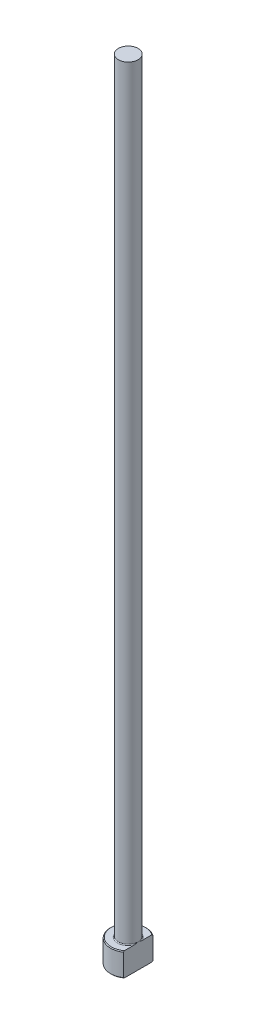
ISO-10303-21;
HEADER;
FILE_DESCRIPTION(('STEP AP214'),'2;1');
FILE_NAME('part.step','',(''),(''),'','','');
FILE_SCHEMA(('AUTOMOTIVE_DESIGN { 1 0 10303 214 1 1 1 1 }'));
ENDSEC;
DATA;
#1=APPLICATION_CONTEXT('core data for automotive mechanical design processes');
#2=APPLICATION_PROTOCOL_DEFINITION('international standard','automotive_design',2000,#1);
#3=PRODUCT_CONTEXT('',#1,'mechanical');
#4=PRODUCT('Part','Part','',(#3));
#5=PRODUCT_RELATED_PRODUCT_CATEGORY('part','',(#4));
#6=PRODUCT_DEFINITION_FORMATION('','',#4);
#7=PRODUCT_DEFINITION_CONTEXT('part definition',#1,'design');
#8=PRODUCT_DEFINITION('design','',#6,#7);
#9=PRODUCT_DEFINITION_SHAPE('','',#8);
#10=(LENGTH_UNIT() NAMED_UNIT(*) SI_UNIT(.MILLI.,.METRE.));
#11=(NAMED_UNIT(*) PLANE_ANGLE_UNIT() SI_UNIT($,.RADIAN.));
#12=(NAMED_UNIT(*) SI_UNIT($,.STERADIAN.) SOLID_ANGLE_UNIT());
#13=UNCERTAINTY_MEASURE_WITH_UNIT(LENGTH_MEASURE(1.E-05),#10,'distance_accuracy_value','');
#14=(GEOMETRIC_REPRESENTATION_CONTEXT(3) GLOBAL_UNCERTAINTY_ASSIGNED_CONTEXT((#13)) GLOBAL_UNIT_ASSIGNED_CONTEXT((#10,
#11,#12)) REPRESENTATION_CONTEXT('',''));
#15=CARTESIAN_POINT('',(0.,0.,0.));
#16=DIRECTION('',(0.,0.,1.));
#17=DIRECTION('',(1.,0.,0.));
#18=AXIS2_PLACEMENT_3D('',#15,#16,#17);
#19=CARTESIAN_POINT('',(0.,0.,0.));
#20=DIRECTION('',(0.,-1.,0.));
#21=DIRECTION('',(0.,0.,-1.));
#22=AXIS2_PLACEMENT_3D('',#19,#20,#21);
#23=PLANE('',#22);
#24=CARTESIAN_POINT('',(0.,0.,0.));
#25=DIRECTION('',(0.,-1.,0.));
#26=DIRECTION('',(0.,0.,-1.));
#27=AXIS2_PLACEMENT_3D('',#24,#25,#26);
#28=CIRCLE('',#27,4.29999999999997);
#29=CARTESIAN_POINT('',(2.49999999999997,0.,3.49857113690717));
#30=VERTEX_POINT('',#29);
#31=CARTESIAN_POINT('',(2.49999999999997,0.,-3.49857113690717));
#32=VERTEX_POINT('',#31);
#33=EDGE_CURVE('E98',#30,#32,#28,.T.);
#34=ORIENTED_EDGE('',*,*,#33,.T.);
#35=DIRECTION('',(0.,0.,1.));
#36=VECTOR('',#35,1.);
#37=CARTESIAN_POINT('',(2.49999999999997,0.,3.74165738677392));
#38=LINE('',#37,#36);
#39=EDGE_CURVE('E83',#32,#30,#38,.T.);
#40=ORIENTED_EDGE('',*,*,#39,.T.);
#41=EDGE_LOOP('',(#34,#40));
#42=FACE_BOUND('',#41,.T.);
#43=ADVANCED_FACE('F32',(#42),#23,.T.);
#44=CARTESIAN_POINT('',(0.,259.958771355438,0.));
#45=DIRECTION('',(0.,1.,0.));
#46=DIRECTION('',(0.,0.,1.));
#47=AXIS2_PLACEMENT_3D('',#44,#45,#46);
#48=CYLINDRICAL_SURFACE('',#47,4.49999999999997);
#49=CARTESIAN_POINT('',(0.,5.80000000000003,0.));
#50=DIRECTION('',(0.,1.,0.));
#51=DIRECTION('',(0.,0.,1.));
#52=AXIS2_PLACEMENT_3D('',#49,#50,#51);
#53=CIRCLE('',#52,4.49999999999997);
#54=CARTESIAN_POINT('',(2.49999999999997,5.80000000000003,3.74165738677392));
#55=VERTEX_POINT('',#54);
#56=CARTESIAN_POINT('',(2.49999999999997,5.80000000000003,-3.74165738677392));
#57=VERTEX_POINT('',#56);
#58=EDGE_CURVE('E104',#55,#57,#53,.F.);
#59=ORIENTED_EDGE('',*,*,#58,.T.);
#60=DIRECTION('',(0.,-1.,0.));
#61=VECTOR('',#60,1.);
#62=CARTESIAN_POINT('',(2.49999999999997,200.,-3.74165738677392));
#63=LINE('',#62,#61);
#64=CARTESIAN_POINT('',(2.49999999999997,0.200000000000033,-3.74165738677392));
#65=VERTEX_POINT('',#64);
#66=EDGE_CURVE('E183',#57,#65,#63,.T.);
#67=ORIENTED_EDGE('',*,*,#66,.T.);
#68=CARTESIAN_POINT('',(0.,0.200000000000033,0.));
#69=DIRECTION('',(0.,-1.,0.));
#70=DIRECTION('',(0.,0.,-1.));
#71=AXIS2_PLACEMENT_3D('',#68,#69,#70);
#72=CIRCLE('',#71,4.49999999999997);
#73=CARTESIAN_POINT('',(2.49999999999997,0.200000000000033,3.74165738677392));
#74=VERTEX_POINT('',#73);
#75=EDGE_CURVE('E100',#65,#74,#72,.F.);
#76=ORIENTED_EDGE('',*,*,#75,.T.);
#77=DIRECTION('',(0.,-1.,0.));
#78=VECTOR('',#77,1.);
#79=CARTESIAN_POINT('',(2.49999999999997,200.,3.74165738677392));
#80=LINE('',#79,#78);
#81=EDGE_CURVE('E93',#55,#74,#80,.T.);
#82=ORIENTED_EDGE('',*,*,#81,.F.);
#83=EDGE_LOOP('',(#59,#67,#76,#82));
#84=FACE_BOUND('',#83,.T.);
#85=ADVANCED_FACE('F158',(#84),#48,.T.);
#86=CARTESIAN_POINT('',(-4.49999999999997,6.,0.));
#87=DIRECTION('',(0.,1.,0.));
#88=DIRECTION('',(0.,0.,1.));
#89=AXIS2_PLACEMENT_3D('',#86,#87,#88);
#90=PLANE('',#89);
#91=CARTESIAN_POINT('',(0.,6.,0.));
#92=DIRECTION('',(0.,1.,0.));
#93=DIRECTION('',(0.,0.,1.));
#94=AXIS2_PLACEMENT_3D('',#91,#92,#93);
#95=CIRCLE('',#94,4.3);
#96=CARTESIAN_POINT('',(2.49999999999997,6.,-3.49857113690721));
#97=VERTEX_POINT('',#96);
#98=CARTESIAN_POINT('',(2.49999999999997,6.,3.49857113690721));
#99=VERTEX_POINT('',#98);
#100=EDGE_CURVE('E178',#97,#99,#95,.T.);
#101=ORIENTED_EDGE('',*,*,#100,.T.);
#102=DIRECTION('',(0.,0.,-1.));
#103=VECTOR('',#102,1.);
#104=CARTESIAN_POINT('',(2.49999999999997,6.,0.));
#105=LINE('',#104,#103);
#106=CARTESIAN_POINT('',(2.49999999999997,5.99999999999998,1.01980390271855));
#107=VERTEX_POINT('',#106);
#108=EDGE_CURVE('E57',#99,#107,#105,.T.);
#109=ORIENTED_EDGE('',*,*,#108,.T.);
#110=CARTESIAN_POINT('',(0.,6.,0.));
#111=DIRECTION('',(0.,1.,0.));
#112=DIRECTION('',(0.,0.,1.));
#113=AXIS2_PLACEMENT_3D('',#110,#111,#112);
#114=CIRCLE('',#113,2.69999999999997);
#115=CARTESIAN_POINT('',(2.49999999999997,5.99999999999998,-1.01980390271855));
#116=VERTEX_POINT('',#115);
#117=EDGE_CURVE('E107',#107,#116,#114,.F.);
#118=ORIENTED_EDGE('',*,*,#117,.T.);
#119=EDGE_CURVE('E136',#116,#97,#105,.T.);
#120=ORIENTED_EDGE('',*,*,#119,.T.);
#121=EDGE_LOOP('',(#101,#109,#118,#120));
#122=FACE_BOUND('',#121,.T.);
#123=ADVANCED_FACE('F147',(#122),#90,.T.);
#124=CARTESIAN_POINT('',(0.,6.00000000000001,0.));
#125=DIRECTION('',(0.,-1.,0.));
#126=DIRECTION('',(0.,0.,-1.));
#127=AXIS2_PLACEMENT_3D('',#124,#125,#126);
#128=CONICAL_SURFACE('',#127,4.3,0.785398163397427);
#129=ORIENTED_EDGE('',*,*,#58,.F.);
#130=CARTESIAN_POINT('',(2.49999999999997,1.69536803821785,8.233449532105));
#131=CARTESIAN_POINT('',(2.49999999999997,1.8415955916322,8.08062583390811));
#132=CARTESIAN_POINT('',(2.49999999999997,1.9876479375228,7.92763429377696));
#133=CARTESIAN_POINT('',(2.49999999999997,2.27932845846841,7.6212454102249));
#134=CARTESIAN_POINT('',(2.49999999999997,2.42495663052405,7.46784806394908));
#135=CARTESIAN_POINT('',(2.49999999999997,2.86116481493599,7.00686753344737));
#136=CARTESIAN_POINT('',(2.49999999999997,3.15099433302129,6.69857321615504));
#137=CARTESIAN_POINT('',(2.49999999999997,3.72884985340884,6.07807253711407));
#138=CARTESIAN_POINT('',(2.49999999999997,4.01686464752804,5.76585569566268));
#139=CARTESIAN_POINT('',(2.49999999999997,4.44539957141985,5.29439081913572));
#140=CARTESIAN_POINT('',(2.49999999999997,4.58765535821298,5.13672163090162));
#141=CARTESIAN_POINT('',(2.49999999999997,4.87066186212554,4.82003964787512));
#142=CARTESIAN_POINT('',(2.49999999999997,5.01141259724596,4.66102686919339));
#143=CARTESIAN_POINT('',(2.49999999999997,5.2957078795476,4.33582683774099));
#144=CARTESIAN_POINT('',(2.49999999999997,5.43918418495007,4.16957975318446));
#145=CARTESIAN_POINT('',(2.49999999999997,5.72327592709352,3.83461659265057));
#146=CARTESIAN_POINT('',(2.49999999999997,5.86389099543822,3.66590020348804));
#147=CARTESIAN_POINT('',(2.49999999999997,6.14107420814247,3.32513857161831));
#148=CARTESIAN_POINT('',(2.49999999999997,6.27764223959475,3.15309323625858));
#149=CARTESIAN_POINT('',(2.49999999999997,6.47795110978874,2.89156777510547));
#150=CARTESIAN_POINT('',(2.49999999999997,6.5439576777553,2.80382460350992));
#151=CARTESIAN_POINT('',(2.49999999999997,6.67408242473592,2.62695176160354));
#152=CARTESIAN_POINT('',(2.49999999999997,6.73820069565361,2.53782215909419));
#153=CARTESIAN_POINT('',(2.49999999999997,6.87152528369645,2.34725612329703));
#154=CARTESIAN_POINT('',(2.49999999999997,6.94043579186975,2.24561149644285));
#155=CARTESIAN_POINT('',(2.49999999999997,7.07436956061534,2.03980429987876));
#156=CARTESIAN_POINT('',(2.49999999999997,7.13939350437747,1.93564217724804));
#157=CARTESIAN_POINT('',(2.49999999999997,7.26425850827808,1.72423874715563));
#158=CARTESIAN_POINT('',(2.49999999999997,7.32410048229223,1.61699798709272));
#159=CARTESIAN_POINT('',(2.49999999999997,7.43673687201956,1.39892979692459));
#160=CARTESIAN_POINT('',(2.49999999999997,7.48953435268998,1.28810395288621));
#161=CARTESIAN_POINT('',(2.49999999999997,7.60157711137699,1.02468144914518));
#162=CARTESIAN_POINT('',(2.49999999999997,7.65714985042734,0.870425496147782));
#163=CARTESIAN_POINT('',(2.49999999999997,7.72191807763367,0.63420526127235));
#164=CARTESIAN_POINT('',(2.49999999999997,7.74039604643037,0.554773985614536));
#165=CARTESIAN_POINT('',(2.49999999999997,7.77027635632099,0.394570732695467));
#166=CARTESIAN_POINT('',(2.49999999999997,7.78167951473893,0.313798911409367));
#167=CARTESIAN_POINT('',(2.49999999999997,7.79679993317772,0.150603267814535));
#168=CARTESIAN_POINT('',(2.49999999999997,7.8004286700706,0.0681710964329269));
#169=CARTESIAN_POINT('',(2.49999999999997,7.7994902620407,-0.0966436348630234));
#170=CARTESIAN_POINT('',(2.49999999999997,7.79492331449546,-0.179026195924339));
#171=CARTESIAN_POINT('',(2.49999999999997,7.77788997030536,-0.343090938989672));
#172=CARTESIAN_POINT('',(2.49999999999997,7.76541077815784,-0.424771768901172));
#173=CARTESIAN_POINT('',(2.49999999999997,7.73330588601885,-0.586708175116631));
#174=CARTESIAN_POINT('',(2.49999999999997,7.71367845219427,-0.666963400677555));
#175=CARTESIAN_POINT('',(2.49999999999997,7.65833470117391,-0.860438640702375));
#176=CARTESIAN_POINT('',(2.49999999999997,7.61933642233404,-0.972715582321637));
#177=CARTESIAN_POINT('',(2.49999999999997,7.53162689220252,-1.19338710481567));
#178=CARTESIAN_POINT('',(2.49999999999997,7.4829089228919,-1.30177893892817));
#179=CARTESIAN_POINT('',(2.49999999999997,7.37798916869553,-1.51554087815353));
#180=CARTESIAN_POINT('',(2.49999999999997,7.3217495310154,-1.62089218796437));
#181=CARTESIAN_POINT('',(2.49999999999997,7.23334776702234,-1.77656150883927));
#182=CARTESIAN_POINT('',(2.49999999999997,7.20321149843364,-1.82805098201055));
#183=CARTESIAN_POINT('',(2.49999999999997,7.14176188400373,-1.93032073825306));
#184=CARTESIAN_POINT('',(2.49999999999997,7.11044858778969,-1.98110105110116));
#185=CARTESIAN_POINT('',(2.49999999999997,7.00428706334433,-2.14944611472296));
#186=CARTESIAN_POINT('',(2.49999999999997,6.9271747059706,-2.26558431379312));
#187=CARTESIAN_POINT('',(2.49999999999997,6.76891329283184,-2.49508800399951));
#188=CARTESIAN_POINT('',(2.49999999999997,6.68776326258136,-2.60845281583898));
#189=CARTESIAN_POINT('',(2.49999999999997,6.5223882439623,-2.83304153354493));
#190=CARTESIAN_POINT('',(2.49999999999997,6.43816097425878,-2.94426375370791));
#191=CARTESIAN_POINT('',(2.49999999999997,6.26739791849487,-3.16492607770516));
#192=CARTESIAN_POINT('',(2.49999999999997,6.18086198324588,-3.27436606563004));
#193=CARTESIAN_POINT('',(2.49999999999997,6.00577178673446,-3.49207549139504));
#194=CARTESIAN_POINT('',(2.49999999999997,5.91721294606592,-3.60034123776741));
#195=CARTESIAN_POINT('',(2.49999999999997,5.7386592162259,-3.81568349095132));
#196=CARTESIAN_POINT('',(2.49999999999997,5.64866429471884,-3.92275997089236));
#197=CARTESIAN_POINT('',(2.49999999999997,5.37704561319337,-4.24242567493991));
#198=CARTESIAN_POINT('',(2.49999999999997,5.19370393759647,-4.45355444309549));
#199=CARTESIAN_POINT('',(2.49999999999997,4.82367634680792,-4.87338717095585));
#200=CARTESIAN_POINT('',(2.49999999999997,4.63698598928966,-5.08208719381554));
#201=CARTESIAN_POINT('',(2.49999999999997,4.26138721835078,-5.49751911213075));
#202=CARTESIAN_POINT('',(2.49999999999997,4.0724785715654,-5.70425079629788));
#203=CARTESIAN_POINT('',(2.49999999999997,3.6932962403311,-6.11595801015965));
#204=CARTESIAN_POINT('',(2.49999999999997,3.50302465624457,-6.32093547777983));
#205=CARTESIAN_POINT('',(2.49999999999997,3.12126439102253,-6.72975403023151));
#206=CARTESIAN_POINT('',(2.49999999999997,2.92977570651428,-6.93359511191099));
#207=CARTESIAN_POINT('',(2.49999999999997,2.65119470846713,-7.22877144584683));
#208=CARTESIAN_POINT('',(2.49999999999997,2.5644779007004,-7.32046158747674));
#209=CARTESIAN_POINT('',(2.49999999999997,2.39085496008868,-7.50369470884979));
#210=CARTESIAN_POINT('',(2.49999999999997,2.30394879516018,-7.59523765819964));
#211=CARTESIAN_POINT('',(2.49999999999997,2.13016920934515,-7.77797738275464));
#212=CARTESIAN_POINT('',(2.49999999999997,2.04329612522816,-7.8691744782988));
#213=CARTESIAN_POINT('',(2.49999999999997,1.86942568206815,-8.05141764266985));
#214=CARTESIAN_POINT('',(2.49999999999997,1.78242834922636,-8.14246373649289));
#215=CARTESIAN_POINT('',(2.49999999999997,1.69536803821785,-8.233449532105));
#216=B_SPLINE_CURVE_WITH_KNOTS('',3,(#130,#131,#132,#133,#134,#135,#136,#137,#138,#139,#140,
#141,#142,#143,#144,#145,#146,#147,#148,#149,#150,#151,#152,#153,#154,#155,#156,#157,#158,#159,
#160,#161,#162,#163,#164,#165,#166,#167,#168,#169,#170,#171,#172,#173,#174,#175,#176,#177,#178,
#179,#180,#181,#182,#183,#184,#185,#186,#187,#188,#189,#190,#191,#192,#193,#194,#195,#196,#197,
#198,#199,#200,#201,#202,#203,#204,#205,#206,#207,#208,#209,#210,#211,#212,#213,#214,#215),
.UNSPECIFIED.,.F.,.F.,(4,2,2,2,2,2,2,2,2,2,2,2,2,2,2,2,2,2,2,2,2,2,2,2,2,2,2,2,2,2,2,2,2,2,2,2,
2,2,2,2,2,2,4),(0.,0.634537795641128,1.26908006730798,2.53848610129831,3.81276948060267,
4.44983884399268,5.08690057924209,5.74567154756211,6.40452680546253,7.06340042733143,
7.3927766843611,7.7221368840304,8.09047335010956,8.45874487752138,8.82695132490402,
9.19499704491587,9.6851523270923,9.92954493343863,10.1739093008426,10.421041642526,
10.6681680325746,10.915695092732,11.1632822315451,11.5192140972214,11.8753928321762,
12.2334366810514,12.4124062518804,12.5913682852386,13.0094573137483,13.4276477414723,
13.8461547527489,14.2646888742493,14.6842890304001,15.1038986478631,15.942718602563,
16.7827484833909,17.6228675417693,18.4618914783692,19.3009177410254,19.679522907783,
20.0581981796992,20.4360532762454,20.8138378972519),.UNSPECIFIED.);
#217=EDGE_CURVE('E135',#55,#99,#216,.T.);
#218=ORIENTED_EDGE('',*,*,#217,.T.);
#219=ORIENTED_EDGE('',*,*,#100,.F.);
#220=EDGE_CURVE('E127',#97,#57,#216,.T.);
#221=ORIENTED_EDGE('',*,*,#220,.T.);
#222=EDGE_LOOP('',(#129,#218,#219,#221));
#223=FACE_BOUND('',#222,.T.);
#224=ADVANCED_FACE('F143',(#223),#128,.T.);
#225=CARTESIAN_POINT('',(0.,0.200000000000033,0.));
#226=DIRECTION('',(0.,1.,0.));
#227=DIRECTION('',(0.,0.,1.));
#228=AXIS2_PLACEMENT_3D('',#225,#226,#227);
#229=CONICAL_SURFACE('',#228,4.49999999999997,0.785398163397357);
#230=ORIENTED_EDGE('',*,*,#75,.F.);
#231=CARTESIAN_POINT('',(2.49999999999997,4.30463196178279,-8.233449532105));
#232=CARTESIAN_POINT('',(2.49999999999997,4.1584044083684,-8.08062583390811));
#233=CARTESIAN_POINT('',(2.49999999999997,4.01235206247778,-7.92763429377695));
#234=CARTESIAN_POINT('',(2.49999999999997,3.72067154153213,-7.62124541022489));
#235=CARTESIAN_POINT('',(2.49999999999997,3.57504336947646,-7.46784806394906));
#236=CARTESIAN_POINT('',(2.49999999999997,3.13883518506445,-7.00686753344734));
#237=CARTESIAN_POINT('',(2.49999999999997,2.84900566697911,-6.69857321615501));
#238=CARTESIAN_POINT('',(2.49999999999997,2.27115014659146,-6.07807253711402));
#239=CARTESIAN_POINT('',(2.49999999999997,1.98313535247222,-5.76585569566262));
#240=CARTESIAN_POINT('',(2.49999999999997,1.55460042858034,-5.29439081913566));
#241=CARTESIAN_POINT('',(2.49999999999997,1.41234464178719,-5.13672163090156));
#242=CARTESIAN_POINT('',(2.49999999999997,1.12933813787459,-4.82003964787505));
#243=CARTESIAN_POINT('',(2.49999999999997,0.988587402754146,-4.66102686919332));
#244=CARTESIAN_POINT('',(2.49999999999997,0.704292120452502,-4.33582683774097));
#245=CARTESIAN_POINT('',(2.49999999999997,0.560815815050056,-4.16957975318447));
#246=CARTESIAN_POINT('',(2.49999999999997,0.276724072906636,-3.83461659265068));
#247=CARTESIAN_POINT('',(2.49999999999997,0.13610900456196,-3.66590020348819));
#248=CARTESIAN_POINT('',(2.49999999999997,-0.141074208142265,-3.32513857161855));
#249=CARTESIAN_POINT('',(2.49999999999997,-0.277642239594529,-3.15309323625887));
#250=CARTESIAN_POINT('',(2.49999999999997,-0.477951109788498,-2.89156777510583));
#251=CARTESIAN_POINT('',(2.49999999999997,-0.54395767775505,-2.8038246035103));
#252=CARTESIAN_POINT('',(2.49999999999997,-0.674082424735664,-2.62695176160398));
#253=CARTESIAN_POINT('',(2.49999999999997,-0.738200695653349,-2.53782215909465));
#254=CARTESIAN_POINT('',(2.49999999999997,-0.871525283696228,-2.34725612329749));
#255=CARTESIAN_POINT('',(2.49999999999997,-0.940435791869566,-2.24561149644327));
#256=CARTESIAN_POINT('',(2.49999999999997,-1.07436956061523,-2.03980429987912));
#257=CARTESIAN_POINT('',(2.49999999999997,-1.13939350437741,-1.93564217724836));
#258=CARTESIAN_POINT('',(2.49999999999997,-1.26425850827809,-1.72423874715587));
#259=CARTESIAN_POINT('',(2.49999999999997,-1.32410048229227,-1.61699798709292));
#260=CARTESIAN_POINT('',(2.49999999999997,-1.43673687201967,-1.39892979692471));
#261=CARTESIAN_POINT('',(2.49999999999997,-1.48953435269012,-1.28810395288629));
#262=CARTESIAN_POINT('',(2.49999999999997,-1.60157711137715,-1.02468144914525));
#263=CARTESIAN_POINT('',(2.49999999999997,-1.6571498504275,-0.870425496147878));
#264=CARTESIAN_POINT('',(2.49999999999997,-1.72191807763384,-0.634205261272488));
#265=CARTESIAN_POINT('',(2.49999999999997,-1.74039604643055,-0.554773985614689));
#266=CARTESIAN_POINT('',(2.49999999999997,-1.77027635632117,-0.394570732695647));
#267=CARTESIAN_POINT('',(2.49999999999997,-1.78167951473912,-0.31379891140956));
#268=CARTESIAN_POINT('',(2.49999999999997,-1.79679993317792,-0.150603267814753));
#269=CARTESIAN_POINT('',(2.49999999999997,-1.80042867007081,-0.068171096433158));
#270=CARTESIAN_POINT('',(2.49999999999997,-1.79949026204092,0.0966436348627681));
#271=CARTESIAN_POINT('',(2.49999999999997,-1.79492331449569,0.179026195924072));
#272=CARTESIAN_POINT('',(2.49999999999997,-1.77788997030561,0.343090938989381));
#273=CARTESIAN_POINT('',(2.49999999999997,-1.7654107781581,0.424771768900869));
#274=CARTESIAN_POINT('',(2.49999999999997,-1.73330588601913,0.586708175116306));
#275=CARTESIAN_POINT('',(2.49999999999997,-1.71367845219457,0.66696340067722));
#276=CARTESIAN_POINT('',(2.49999999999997,-1.65833470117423,0.860438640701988));
#277=CARTESIAN_POINT('',(2.49999999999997,-1.61933642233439,0.972715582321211));
#278=CARTESIAN_POINT('',(2.49999999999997,-1.53162689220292,1.19338710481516));
#279=CARTESIAN_POINT('',(2.49999999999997,-1.48290892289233,1.30177893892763));
#280=CARTESIAN_POINT('',(2.49999999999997,-1.377989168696,1.51554087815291));
#281=CARTESIAN_POINT('',(2.49999999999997,-1.32174953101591,1.62089218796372));
#282=CARTESIAN_POINT('',(2.49999999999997,-1.23334776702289,1.77656150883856));
#283=CARTESIAN_POINT('',(2.49999999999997,-1.2032114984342,1.82805098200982));
#284=CARTESIAN_POINT('',(2.49999999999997,-1.14176188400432,1.93032073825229));
#285=CARTESIAN_POINT('',(2.49999999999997,-1.1104485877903,1.98110105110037));
#286=CARTESIAN_POINT('',(2.49999999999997,-1.00428706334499,2.1494461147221));
#287=CARTESIAN_POINT('',(2.49999999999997,-0.927174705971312,2.26558431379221));
#288=CARTESIAN_POINT('',(2.49999999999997,-0.768913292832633,2.49508800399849));
#289=CARTESIAN_POINT('',(2.49999999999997,-0.687763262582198,2.60845281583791));
#290=CARTESIAN_POINT('',(2.49999999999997,-0.522388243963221,2.83304153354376));
#291=CARTESIAN_POINT('',(2.49999999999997,-0.438160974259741,2.94426375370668));
#292=CARTESIAN_POINT('',(2.49999999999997,-0.267397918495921,3.16492607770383));
#293=CARTESIAN_POINT('',(2.49999999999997,-0.180861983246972,3.27436606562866));
#294=CARTESIAN_POINT('',(2.49999999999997,-0.00577178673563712,3.49207549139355));
#295=CARTESIAN_POINT('',(2.49999999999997,0.0827870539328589,3.60034123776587));
#296=CARTESIAN_POINT('',(2.49999999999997,0.261340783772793,3.81568349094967));
#297=CARTESIAN_POINT('',(2.49999999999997,0.351335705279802,3.92275997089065));
#298=CARTESIAN_POINT('',(2.49999999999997,0.622954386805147,4.24242567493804));
#299=CARTESIAN_POINT('',(2.49999999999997,0.806296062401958,4.45355444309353));
#300=CARTESIAN_POINT('',(2.49999999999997,1.17632365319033,4.87338717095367));
#301=CARTESIAN_POINT('',(2.49999999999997,1.36301401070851,5.08208719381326));
#302=CARTESIAN_POINT('',(2.49999999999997,1.73861278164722,5.49751911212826));
#303=CARTESIAN_POINT('',(2.49999999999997,1.92752142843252,5.70425079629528));
#304=CARTESIAN_POINT('',(2.49999999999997,2.30670375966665,6.11595801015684));
#305=CARTESIAN_POINT('',(2.49999999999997,2.4969753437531,6.32093547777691));
#306=CARTESIAN_POINT('',(2.49999999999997,2.87873560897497,6.72975403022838));
#307=CARTESIAN_POINT('',(2.49999999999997,3.07022429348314,6.93359511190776));
#308=CARTESIAN_POINT('',(2.49999999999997,3.34880529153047,7.22877144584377));
#309=CARTESIAN_POINT('',(2.49999999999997,3.43552209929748,7.32046158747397));
#310=CARTESIAN_POINT('',(2.49999999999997,3.60914503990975,7.50369470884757));
#311=CARTESIAN_POINT('',(2.49999999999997,3.69605120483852,7.5952376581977));
#312=CARTESIAN_POINT('',(2.49999999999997,3.8698307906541,7.77797738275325));
#313=CARTESIAN_POINT('',(2.49999999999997,3.95670387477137,7.8691744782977));
#314=CARTESIAN_POINT('',(2.49999999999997,4.13057431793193,8.0514176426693));
#315=CARTESIAN_POINT('',(2.49999999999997,4.21757165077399,8.14246373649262));
#316=CARTESIAN_POINT('',(2.49999999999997,4.30463196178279,8.233449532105));
#317=B_SPLINE_CURVE_WITH_KNOTS('',3,(#231,#232,#233,#234,#235,#236,#237,#238,#239,#240,#241,
#242,#243,#244,#245,#246,#247,#248,#249,#250,#251,#252,#253,#254,#255,#256,#257,#258,#259,#260,
#261,#262,#263,#264,#265,#266,#267,#268,#269,#270,#271,#272,#273,#274,#275,#276,#277,#278,#279,
#280,#281,#282,#283,#284,#285,#286,#287,#288,#289,#290,#291,#292,#293,#294,#295,#296,#297,#298,
#299,#300,#301,#302,#303,#304,#305,#306,#307,#308,#309,#310,#311,#312,#313,#314,#315,#316),
.UNSPECIFIED.,.F.,.F.,(4,2,2,2,2,2,2,2,2,2,2,2,2,2,2,2,2,2,2,2,2,2,2,2,2,2,2,2,2,2,2,2,2,2,2,2,
2,2,2,2,2,2,4),(0.,0.634537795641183,1.26908006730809,2.53848610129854,3.81276948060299,
4.44983884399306,5.08690057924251,5.7456715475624,6.40452680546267,7.06340042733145,
7.39277668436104,7.72213688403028,8.09047335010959,8.45874487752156,8.82695132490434,
9.19499704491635,9.6851523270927,9.929544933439,10.1739093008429,10.4210416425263,
10.6681680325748,10.9156950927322,11.1632822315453,11.5192140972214,11.8753928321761,
12.2334366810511,12.4124062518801,12.5913682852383,13.0094573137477,13.4276477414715,
13.8461547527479,14.2646888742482,14.6842890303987,15.1038986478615,15.942718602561,
16.7827484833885,17.6228675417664,18.461891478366,19.3009177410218,19.6795229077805,
20.0581981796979,20.4360532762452,20.8138378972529),.UNSPECIFIED.);
#318=EDGE_CURVE('E86',#65,#32,#317,.T.);
#319=ORIENTED_EDGE('',*,*,#318,.T.);
#320=ORIENTED_EDGE('',*,*,#33,.F.);
#321=EDGE_CURVE('E89',#30,#74,#317,.T.);
#322=ORIENTED_EDGE('',*,*,#321,.T.);
#323=EDGE_LOOP('',(#230,#319,#320,#322));
#324=FACE_BOUND('',#323,.T.);
#325=ADVANCED_FACE('F97',(#324),#229,.T.);
#326=CARTESIAN_POINT('',(0.,6.19999999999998,0.));
#327=DIRECTION('',(0.,1.,0.));
#328=DIRECTION('',(0.,0.,1.));
#329=AXIS2_PLACEMENT_3D('',#326,#327,#328);
#330=TOROIDAL_SURFACE('',#329,2.69999999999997,0.2);
#331=CARTESIAN_POINT('',(2.49999999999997,6.19999999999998,0.));
#332=CARTESIAN_POINT('',(2.49999999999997,6.20000050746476,5.29062847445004E-11));
#333=CARTESIAN_POINT('',(2.49999999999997,6.20000101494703,-1.70517162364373E-07));
#334=CARTESIAN_POINT('',(2.49999999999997,6.20000196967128,-6.59443816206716E-07));
#335=CARTESIAN_POINT('',(2.49999999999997,6.20000240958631,-9.87883937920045E-07));
#336=CARTESIAN_POINT('',(2.49999999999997,6.20000331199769,-1.77246894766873E-06));
#337=CARTESIAN_POINT('',(2.49999999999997,6.20000376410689,-2.24097231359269E-06));
#338=CARTESIAN_POINT('',(2.49999999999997,6.20000458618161,-3.2218605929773E-06));
#339=CARTESIAN_POINT('',(2.49999999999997,6.20000495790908,-3.73286589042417E-06));
#340=CARTESIAN_POINT('',(2.49999999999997,6.20000630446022,-5.67453785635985E-06));
#341=CARTESIAN_POINT('',(2.49999999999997,6.20000720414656,-7.15943630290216E-06));
#342=CARTESIAN_POINT('',(2.49999999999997,6.20000871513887,-1.01304383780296E-05));
#343=CARTESIAN_POINT('',(2.49999999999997,6.20000934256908,-1.16087238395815E-05));
#344=CARTESIAN_POINT('',(2.49999999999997,6.20001191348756,-1.77555556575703E-05));
#345=CARTESIAN_POINT('',(2.49999999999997,6.20001378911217,-2.24564507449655E-05));
#346=CARTESIAN_POINT('',(2.49999999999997,6.20001661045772,-3.14167103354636E-05));
#347=CARTESIAN_POINT('',(2.49999999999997,6.20001764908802,-3.56468504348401E-05));
#348=CARTESIAN_POINT('',(2.49999999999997,6.2000251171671,-6.67543463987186E-05));
#349=CARTESIAN_POINT('',(2.49999999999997,6.20003067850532,-9.37930228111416E-05));
#350=CARTESIAN_POINT('',(2.49999999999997,6.20005501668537,-0.00020029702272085));
#351=CARTESIAN_POINT('',(2.49999999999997,6.20007833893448,-0.000278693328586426));
#352=CARTESIAN_POINT('',(2.49999999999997,6.20016883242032,-0.00058841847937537));
#353=CARTESIAN_POINT('',(2.49999999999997,6.20023298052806,-0.000820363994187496));
#354=CARTESIAN_POINT('',(2.49999999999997,6.20048923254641,-0.00173961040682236));
#355=CARTESIAN_POINT('',(2.49999999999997,6.20068508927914,-0.00242612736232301));
#356=CARTESIAN_POINT('',(2.49999999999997,6.20149752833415,-0.00528196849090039));
#357=CARTESIAN_POINT('',(2.49999999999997,6.20210941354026,-0.00745227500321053));
#358=CARTESIAN_POINT('',(2.49999999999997,6.20774599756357,-0.027434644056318));
#359=CARTESIAN_POINT('',(2.49999999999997,6.21279017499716,-0.0452427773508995));
#360=CARTESIAN_POINT('',(2.49999999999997,6.22264347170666,-0.0801677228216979));
#361=CARTESIAN_POINT('',(2.49999999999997,6.22745402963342,-0.0972841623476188));
#362=CARTESIAN_POINT('',(2.49999999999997,6.23763483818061,-0.133672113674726));
#363=CARTESIAN_POINT('',(2.49999999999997,6.24299975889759,-0.152945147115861));
#364=CARTESIAN_POINT('',(2.49999999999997,6.25370389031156,-0.191722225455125));
#365=CARTESIAN_POINT('',(2.49999999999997,6.25904219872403,-0.211226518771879));
#366=CARTESIAN_POINT('',(2.49999999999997,6.27184445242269,-0.258540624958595));
#367=CARTESIAN_POINT('',(2.49999999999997,6.27925018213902,-0.286366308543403));
#368=CARTESIAN_POINT('',(2.49999999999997,6.29355148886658,-0.341371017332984));
#369=CARTESIAN_POINT('',(2.49999999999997,6.30045534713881,-0.368547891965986));
#370=CARTESIAN_POINT('',(2.49999999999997,6.31991129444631,-0.447507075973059));
#371=CARTESIAN_POINT('',(2.49999999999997,6.3319536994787,-0.499417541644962));
#372=CARTESIAN_POINT('',(2.49999999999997,6.35404241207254,-0.604188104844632));
#373=CARTESIAN_POINT('',(2.49999999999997,6.36406867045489,-0.657052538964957));
#374=CARTESIAN_POINT('',(2.49999999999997,6.38176575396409,-0.767598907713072));
#375=CARTESIAN_POINT('',(2.49999999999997,6.38917909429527,-0.825323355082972));
#376=CARTESIAN_POINT('',(2.49999999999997,6.39884096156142,-0.941055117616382));
#377=CARTESIAN_POINT('',(2.49999999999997,6.40111055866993,-0.999060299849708));
#378=CARTESIAN_POINT('',(2.49999999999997,6.39847691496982,-1.09324578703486));
#379=CARTESIAN_POINT('',(2.49999999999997,6.39593644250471,-1.12948454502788));
#380=CARTESIAN_POINT('',(2.49999999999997,6.38674319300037,-1.20096926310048));
#381=CARTESIAN_POINT('',(2.49999999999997,6.38015410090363,-1.23622192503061));
#382=CARTESIAN_POINT('',(2.49999999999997,6.36639936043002,-1.28579148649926));
#383=CARTESIAN_POINT('',(2.49999999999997,6.36162670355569,-1.30076836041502));
#384=CARTESIAN_POINT('',(2.49999999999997,6.35062798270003,-1.33028325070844));
#385=CARTESIAN_POINT('',(2.49999999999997,6.34439458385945,-1.34481861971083));
#386=CARTESIAN_POINT('',(2.49999999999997,6.33003808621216,-1.37319413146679));
#387=CARTESIAN_POINT('',(2.49999999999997,6.3218901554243,-1.3870219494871));
#388=CARTESIAN_POINT('',(2.49999999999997,6.3032536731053,-1.41298115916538));
#389=CARTESIAN_POINT('',(2.49999999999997,6.29278241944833,-1.42512406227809));
#390=CARTESIAN_POINT('',(2.49999999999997,6.27569207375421,-1.44029611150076));
#391=CARTESIAN_POINT('',(2.49999999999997,6.27021837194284,-1.44461019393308));
#392=CARTESIAN_POINT('',(2.49999999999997,6.25870897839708,-1.45242709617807));
#393=CARTESIAN_POINT('',(2.49999999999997,6.25267333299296,-1.4559299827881));
#394=CARTESIAN_POINT('',(2.49999999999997,6.2400193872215,-1.46191450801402));
#395=CARTESIAN_POINT('',(2.49999999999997,6.23339520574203,-1.46438399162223));
#396=CARTESIAN_POINT('',(2.49999999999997,6.21979347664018,-1.46798853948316));
#397=CARTESIAN_POINT('',(2.49999999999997,6.21281651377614,-1.46912574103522));
#398=CARTESIAN_POINT('',(2.49999999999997,6.19961348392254,-1.46988240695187));
#399=CARTESIAN_POINT('',(2.49999999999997,6.19339654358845,-1.46966594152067));
#400=CARTESIAN_POINT('',(2.49999999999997,6.18110362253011,-1.46811597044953));
#401=CARTESIAN_POINT('',(2.49999999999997,6.17502769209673,-1.46678207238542));
#402=CARTESIAN_POINT('',(2.49999999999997,6.16354702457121,-1.46323301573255));
#403=CARTESIAN_POINT('',(2.49999999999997,6.15812390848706,-1.46107586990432));
#404=CARTESIAN_POINT('',(2.49999999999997,6.14763458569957,-1.45603007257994));
#405=CARTESIAN_POINT('',(2.49999999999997,6.1425684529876,-1.45314127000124));
#406=CARTESIAN_POINT('',(2.49999999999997,6.12963191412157,-1.44468844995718));
#407=CARTESIAN_POINT('',(2.49999999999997,6.1220971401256,-1.43861122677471));
#408=CARTESIAN_POINT('',(2.49999999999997,6.10805350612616,-1.42536327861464));
#409=CARTESIAN_POINT('',(2.49999999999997,6.1015482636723,-1.41818886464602));
#410=CARTESIAN_POINT('',(2.49999999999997,6.08513615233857,-1.39772885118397));
#411=CARTESIAN_POINT('',(2.49999999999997,6.07611692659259,-1.38373739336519));
#412=CARTESIAN_POINT('',(2.49999999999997,6.06018433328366,-1.35465370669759));
#413=CARTESIAN_POINT('',(2.49999999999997,6.05327247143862,-1.33956070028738));
#414=CARTESIAN_POINT('',(2.49999999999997,6.04107204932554,-1.30868385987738));
#415=CARTESIAN_POINT('',(2.49999999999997,6.03578911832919,-1.29289784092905));
#416=CARTESIAN_POINT('',(2.49999999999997,6.02655583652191,-1.26093375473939));
#417=CARTESIAN_POINT('',(2.49999999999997,6.02260692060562,-1.244755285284));
#418=CARTESIAN_POINT('',(2.49999999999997,6.01232854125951,-1.19551094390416));
#419=CARTESIAN_POINT('',(2.49999999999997,6.00769429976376,-1.16209442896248));
#420=CARTESIAN_POINT('',(2.49999999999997,6.00005311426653,-1.07761506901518));
#421=CARTESIAN_POINT('',(2.49999999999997,5.99913690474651,-1.02638928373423));
#422=CARTESIAN_POINT('',(2.49999999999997,6.00223345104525,-0.92394747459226));
#423=CARTESIAN_POINT('',(2.49999999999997,6.00626667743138,-0.872732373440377));
#424=CARTESIAN_POINT('',(2.49999999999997,6.01749958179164,-0.773934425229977));
#425=CARTESIAN_POINT('',(2.49999999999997,6.02448410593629,-0.726325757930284));
#426=CARTESIAN_POINT('',(2.49999999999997,6.04066526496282,-0.631906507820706));
#427=CARTESIAN_POINT('',(2.49999999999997,6.04984293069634,-0.585092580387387));
#428=CARTESIAN_POINT('',(2.49999999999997,6.06791405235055,-0.500780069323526));
#429=CARTESIAN_POINT('',(2.49999999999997,6.07652349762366,-0.463219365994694));
#430=CARTESIAN_POINT('',(2.49999999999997,6.0947810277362,-0.387318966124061));
#431=CARTESIAN_POINT('',(2.49999999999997,6.10445029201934,-0.348984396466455));
#432=CARTESIAN_POINT('',(2.49999999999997,6.12135487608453,-0.284095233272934));
#433=CARTESIAN_POINT('',(2.49999999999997,6.12843710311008,-0.257500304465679));
#434=CARTESIAN_POINT('',(2.49999999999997,6.14273562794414,-0.204655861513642));
#435=CARTESIAN_POINT('',(2.49999999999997,6.14994963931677,-0.178405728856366));
#436=CARTESIAN_POINT('',(2.49999999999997,6.16369218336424,-0.128877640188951));
#437=CARTESIAN_POINT('',(2.49999999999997,6.17020707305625,-0.105595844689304));
#438=CARTESIAN_POINT('',(2.49999999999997,6.18358099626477,-0.0580847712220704));
#439=CARTESIAN_POINT('',(2.49999999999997,6.19044308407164,-0.0338563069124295));
#440=CARTESIAN_POINT('',(2.49999999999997,6.19789108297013,-0.00745034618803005));
#441=CARTESIAN_POINT('',(2.49999999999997,6.19850354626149,-0.0052781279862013));
#442=CARTESIAN_POINT('',(2.49999999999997,6.19931612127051,-0.00242184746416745));
#443=CARTESIAN_POINT('',(2.49999999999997,6.19951155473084,-0.00173680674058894));
#444=CARTESIAN_POINT('',(2.49999999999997,6.1997672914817,-0.000819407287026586));
#445=CARTESIAN_POINT('',(2.49999999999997,6.19983133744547,-0.00058783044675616));
#446=CARTESIAN_POINT('',(2.49999999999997,6.19992170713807,-0.000278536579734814));
#447=CARTESIAN_POINT('',(2.49999999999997,6.1999450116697,-0.000200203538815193));
#448=CARTESIAN_POINT('',(2.49999999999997,6.19996933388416,-9.37727605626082E-05));
#449=CARTESIAN_POINT('',(2.49999999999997,6.19997489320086,-6.67431743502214E-05));
#450=CARTESIAN_POINT('',(2.49999999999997,6.19998235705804,-3.56449050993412E-05));
#451=CARTESIAN_POINT('',(2.49999999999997,6.199983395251,-3.14152907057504E-05));
#452=CARTESIAN_POINT('',(2.49999999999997,6.19998621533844,-2.24560903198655E-05));
#453=CARTESIAN_POINT('',(2.49999999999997,6.1999880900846,-1.77557010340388E-05));
#454=CARTESIAN_POINT('',(2.49999999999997,6.19999065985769,-1.16093872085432E-05));
#455=CARTESIAN_POINT('',(2.49999999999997,6.19999128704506,-1.01311411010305E-05));
#456=CARTESIAN_POINT('',(2.49999999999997,6.19999279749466,-7.16017598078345E-06));
#457=CARTESIAN_POINT('',(2.49999999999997,6.19999369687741,-5.67527059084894E-06));
#458=CARTESIAN_POINT('',(2.49999999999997,6.19999504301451,-3.73354017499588E-06));
#459=CARTESIAN_POINT('',(2.49999999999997,6.19999541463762,-3.22250656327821E-06));
#460=CARTESIAN_POINT('',(2.49999999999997,6.19999623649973,-2.24154282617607E-06));
#461=CARTESIAN_POINT('',(2.49999999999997,6.19999668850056,-1.7729917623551E-06));
#462=CARTESIAN_POINT('',(2.49999999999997,6.19999759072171,-9.8829378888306E-07));
#463=CARTESIAN_POINT('',(2.49999999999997,6.19999803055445,-6.59792290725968E-07));
#464=CARTESIAN_POINT('',(2.49999999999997,6.19999898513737,-1.70712159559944E-07));
#465=CARTESIAN_POINT('',(2.49999999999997,6.19999949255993,-5.29037075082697E-11));
#466=CARTESIAN_POINT('',(2.49999999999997,6.19999999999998,0.));
#467=B_SPLINE_CURVE_WITH_KNOTS('',3,(#331,#332,#333,#334,#335,#336,#337,#338,#339,#340,#341,
#342,#343,#344,#345,#346,#347,#348,#349,#350,#351,#352,#353,#354,#355,#356,#357,#358,#359,#360,
#361,#362,#363,#364,#365,#366,#367,#368,#369,#370,#371,#372,#373,#374,#375,#376,#377,#378,#379,
#380,#381,#382,#383,#384,#385,#386,#387,#388,#389,#390,#391,#392,#393,#394,#395,#396,#397,#398,
#399,#400,#401,#402,#403,#404,#405,#406,#407,#408,#409,#410,#411,#412,#413,#414,#415,#416,#417,
#418,#419,#420,#421,#422,#423,#424,#425,#426,#427,#428,#429,#430,#431,#432,#433,#434,#435,#436,
#437,#438,#439,#440,#441,#442,#443,#444,#445,#446,#447,#448,#449,#450,#451,#452,#453,#454,#455,
#456,#457,#458,#459,#460,#461,#462,#463,#464,#465,#466),.UNSPECIFIED.,.T.,.F.,(4,2,2,2,2,2,2,2,
2,2,2,2,2,2,2,2,2,2,2,2,2,2,2,2,2,2,2,2,2,2,2,2,2,2,2,2,2,2,2,2,2,2,2,2,2,2,2,2,2,2,2,2,2,2,2,2,
2,2,2,2,2,2,2,2,2,2,2,4),(0.,1.5300298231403E-06,3.17429883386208E-06,5.116929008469E-06,
7.01128921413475E-06,1.2199317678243E-05,1.70129963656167E-05,3.21659457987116E-05,
4.52166483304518E-05,0.00012804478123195,0.000373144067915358,0.00109538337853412,
0.00323676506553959,0.0100018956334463,0.0655261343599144,0.118865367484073,0.178882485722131,
0.239547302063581,0.325928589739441,0.410047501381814,0.569885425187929,0.731241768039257,
0.905704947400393,1.07945217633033,1.18829443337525,1.2954669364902,1.34257193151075,
1.38991872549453,1.43791728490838,1.48556980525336,1.50642342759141,1.52727533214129,
1.5483660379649,1.5694228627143,1.58798129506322,1.6065462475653,1.62399133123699,
1.64144002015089,1.67031274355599,1.69928476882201,1.74894310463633,1.79863683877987,
1.84850042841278,1.89841748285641,1.99938099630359,2.15271136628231,2.30667804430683,
2.45095908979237,2.59403470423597,2.70962861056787,2.82822694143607,2.91079145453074,
2.99246070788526,3.06498967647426,3.14053132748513,3.14730244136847,3.1494392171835,
3.15016030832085,3.15040521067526,3.15048801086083,3.15050105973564,3.15051621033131,
3.15052102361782,3.15052621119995,3.15052810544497,3.1505300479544,3.15053169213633,
3.15053322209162),.UNSPECIFIED.);
#468=CARTESIAN_POINT('',(2.49999999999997,6.19999999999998,0.));
#469=VERTEX_POINT('',#468);
#470=EDGE_CURVE('E11',#116,#469,#467,.T.);
#471=ORIENTED_EDGE('',*,*,#470,.F.);
#472=ORIENTED_EDGE('',*,*,#117,.F.);
#473=CARTESIAN_POINT('',(2.49999999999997,6.19999999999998,0.));
#474=CARTESIAN_POINT('',(2.49999999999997,6.19999949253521,-5.29062769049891E-11));
#475=CARTESIAN_POINT('',(2.49999999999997,6.19999898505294,1.70517162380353E-07));
#476=CARTESIAN_POINT('',(2.49999999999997,6.19999803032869,6.5944381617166E-07));
#477=CARTESIAN_POINT('',(2.49999999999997,6.19999759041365,9.87883937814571E-07));
#478=CARTESIAN_POINT('',(2.49999999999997,6.19999668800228,1.77246894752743E-06));
#479=CARTESIAN_POINT('',(2.49999999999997,6.19999623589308,2.24097231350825E-06));
#480=CARTESIAN_POINT('',(2.49999999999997,6.19999541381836,3.22186059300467E-06));
#481=CARTESIAN_POINT('',(2.49999999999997,6.19999504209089,3.73286589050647E-06));
#482=CARTESIAN_POINT('',(2.49999999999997,6.19999369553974,5.67453785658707E-06));
#483=CARTESIAN_POINT('',(2.49999999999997,6.19999279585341,7.15943630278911E-06));
#484=CARTESIAN_POINT('',(2.49999999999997,6.1999912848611,1.01304383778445E-05));
#485=CARTESIAN_POINT('',(2.49999999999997,6.19999065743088,1.1608723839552E-05));
#486=CARTESIAN_POINT('',(2.49999999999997,6.19998808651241,1.77555556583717E-05));
#487=CARTESIAN_POINT('',(2.49999999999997,6.1999862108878,2.24564507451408E-05));
#488=CARTESIAN_POINT('',(2.49999999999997,6.19998338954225,3.14167103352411E-05));
#489=CARTESIAN_POINT('',(2.49999999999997,6.19998235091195,3.56468504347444E-05));
#490=CARTESIAN_POINT('',(2.49999999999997,6.19997488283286,6.67543463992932E-05));
#491=CARTESIAN_POINT('',(2.49999999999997,6.19996932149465,9.37930228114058E-05));
#492=CARTESIAN_POINT('',(2.49999999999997,6.1999449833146,0.000200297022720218));
#493=CARTESIAN_POINT('',(2.49999999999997,6.19992166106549,0.000278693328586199));
#494=CARTESIAN_POINT('',(2.49999999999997,6.19983116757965,0.000588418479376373));
#495=CARTESIAN_POINT('',(2.49999999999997,6.19976701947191,0.000820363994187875));
#496=CARTESIAN_POINT('',(2.49999999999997,6.19951076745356,0.00173961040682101));
#497=CARTESIAN_POINT('',(2.49999999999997,6.19931491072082,0.00242612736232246));
#498=CARTESIAN_POINT('',(2.49999999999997,6.19850247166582,0.00528196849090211));
#499=CARTESIAN_POINT('',(2.49999999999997,6.19789058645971,0.00745227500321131));
#500=CARTESIAN_POINT('',(2.49999999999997,6.19225400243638,0.0274346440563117));
#501=CARTESIAN_POINT('',(2.49999999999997,6.1872098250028,0.045242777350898));
#502=CARTESIAN_POINT('',(2.49999999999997,6.17735652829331,0.0801677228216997));
#503=CARTESIAN_POINT('',(2.49999999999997,6.17254597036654,0.0972841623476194));
#504=CARTESIAN_POINT('',(2.49999999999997,6.16236516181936,0.133672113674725));
#505=CARTESIAN_POINT('',(2.49999999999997,6.15700024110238,0.152945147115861));
#506=CARTESIAN_POINT('',(2.49999999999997,6.1462961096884,0.191722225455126));
#507=CARTESIAN_POINT('',(2.49999999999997,6.14095780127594,0.211226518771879));
#508=CARTESIAN_POINT('',(2.49999999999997,6.12815554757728,0.258540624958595));
#509=CARTESIAN_POINT('',(2.49999999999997,6.12074981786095,0.286366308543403));
#510=CARTESIAN_POINT('',(2.49999999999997,6.10644851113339,0.341371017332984));
#511=CARTESIAN_POINT('',(2.49999999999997,6.09954465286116,0.368547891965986));
#512=CARTESIAN_POINT('',(2.49999999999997,6.08008870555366,0.447507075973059));
#513=CARTESIAN_POINT('',(2.49999999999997,6.06804630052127,0.499417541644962));
#514=CARTESIAN_POINT('',(2.49999999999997,6.04595758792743,0.604188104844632));
#515=CARTESIAN_POINT('',(2.49999999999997,6.03593132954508,0.657052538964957));
#516=CARTESIAN_POINT('',(2.49999999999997,6.01823424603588,0.767598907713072));
#517=CARTESIAN_POINT('',(2.49999999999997,6.0108209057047,0.825323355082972));
#518=CARTESIAN_POINT('',(2.49999999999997,6.00115903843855,0.941055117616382));
#519=CARTESIAN_POINT('',(2.49999999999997,5.99888944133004,0.999060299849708));
#520=CARTESIAN_POINT('',(2.49999999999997,6.00152308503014,1.09324578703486));
#521=CARTESIAN_POINT('',(2.49999999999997,6.00406355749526,1.12948454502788));
#522=CARTESIAN_POINT('',(2.49999999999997,6.0132568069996,1.20096926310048));
#523=CARTESIAN_POINT('',(2.49999999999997,6.01984589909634,1.23622192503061));
#524=CARTESIAN_POINT('',(2.49999999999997,6.03360063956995,1.28579148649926));
#525=CARTESIAN_POINT('',(2.49999999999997,6.03837329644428,1.30076836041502));
#526=CARTESIAN_POINT('',(2.49999999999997,6.04937201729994,1.33028325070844));
#527=CARTESIAN_POINT('',(2.49999999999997,6.05560541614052,1.34481861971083));
#528=CARTESIAN_POINT('',(2.49999999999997,6.06996191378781,1.37319413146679));
#529=CARTESIAN_POINT('',(2.49999999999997,6.07810984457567,1.3870219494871));
#530=CARTESIAN_POINT('',(2.49999999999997,6.09674632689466,1.41298115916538));
#531=CARTESIAN_POINT('',(2.49999999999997,6.10721758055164,1.42512406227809));
#532=CARTESIAN_POINT('',(2.49999999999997,6.12430792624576,1.44029611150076));
#533=CARTESIAN_POINT('',(2.49999999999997,6.12978162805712,1.44461019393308));
#534=CARTESIAN_POINT('',(2.49999999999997,6.14129102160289,1.45242709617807));
#535=CARTESIAN_POINT('',(2.49999999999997,6.14732666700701,1.4559299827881));
#536=CARTESIAN_POINT('',(2.49999999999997,6.15998061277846,1.46191450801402));
#537=CARTESIAN_POINT('',(2.49999999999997,6.16660479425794,1.46438399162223));
#538=CARTESIAN_POINT('',(2.49999999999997,6.18020652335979,1.46798853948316));
#539=CARTESIAN_POINT('',(2.49999999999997,6.18718348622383,1.46912574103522));
#540=CARTESIAN_POINT('',(2.49999999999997,6.20038651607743,1.46988240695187));
#541=CARTESIAN_POINT('',(2.49999999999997,6.20660345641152,1.46966594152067));
#542=CARTESIAN_POINT('',(2.49999999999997,6.21889637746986,1.46811597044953));
#543=CARTESIAN_POINT('',(2.49999999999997,6.22497230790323,1.46678207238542));
#544=CARTESIAN_POINT('',(2.49999999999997,6.23645297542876,1.46323301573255));
#545=CARTESIAN_POINT('',(2.49999999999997,6.24187609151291,1.46107586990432));
#546=CARTESIAN_POINT('',(2.49999999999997,6.25236541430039,1.45603007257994));
#547=CARTESIAN_POINT('',(2.49999999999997,6.25743154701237,1.45314127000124));
#548=CARTESIAN_POINT('',(2.49999999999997,6.2703680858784,1.44468844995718));
#549=CARTESIAN_POINT('',(2.49999999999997,6.27790285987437,1.43861122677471));
#550=CARTESIAN_POINT('',(2.49999999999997,6.29194649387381,1.42536327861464));
#551=CARTESIAN_POINT('',(2.49999999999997,6.29845173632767,1.41818886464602));
#552=CARTESIAN_POINT('',(2.49999999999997,6.31486384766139,1.39772885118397));
#553=CARTESIAN_POINT('',(2.49999999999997,6.32388307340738,1.38373739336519));
#554=CARTESIAN_POINT('',(2.49999999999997,6.33981566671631,1.35465370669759));
#555=CARTESIAN_POINT('',(2.49999999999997,6.34672752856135,1.33956070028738));
#556=CARTESIAN_POINT('',(2.49999999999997,6.35892795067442,1.30868385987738));
#557=CARTESIAN_POINT('',(2.49999999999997,6.36421088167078,1.29289784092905));
#558=CARTESIAN_POINT('',(2.49999999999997,6.37344416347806,1.26093375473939));
#559=CARTESIAN_POINT('',(2.49999999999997,6.37739307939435,1.244755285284));
#560=CARTESIAN_POINT('',(2.49999999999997,6.38767145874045,1.19551094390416));
#561=CARTESIAN_POINT('',(2.49999999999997,6.3923057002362,1.16209442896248));
#562=CARTESIAN_POINT('',(2.49999999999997,6.39994688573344,1.07761506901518));
#563=CARTESIAN_POINT('',(2.49999999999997,6.40086309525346,1.02638928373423));
#564=CARTESIAN_POINT('',(2.49999999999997,6.39776654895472,0.92394747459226));
#565=CARTESIAN_POINT('',(2.49999999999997,6.39373332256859,0.872732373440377));
#566=CARTESIAN_POINT('',(2.49999999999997,6.38250041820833,0.773934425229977));
#567=CARTESIAN_POINT('',(2.49999999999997,6.37551589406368,0.726325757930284));
#568=CARTESIAN_POINT('',(2.49999999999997,6.35933473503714,0.631906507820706));
#569=CARTESIAN_POINT('',(2.49999999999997,6.35015706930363,0.585092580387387));
#570=CARTESIAN_POINT('',(2.49999999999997,6.33208594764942,0.500780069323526));
#571=CARTESIAN_POINT('',(2.49999999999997,6.3234765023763,0.463219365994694));
#572=CARTESIAN_POINT('',(2.49999999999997,6.30521897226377,0.387318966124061));
#573=CARTESIAN_POINT('',(2.49999999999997,6.29554970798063,0.348984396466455));
#574=CARTESIAN_POINT('',(2.49999999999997,6.27864512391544,0.284095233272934));
#575=CARTESIAN_POINT('',(2.49999999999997,6.27156289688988,0.257500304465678));
#576=CARTESIAN_POINT('',(2.49999999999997,6.25726437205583,0.204655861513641));
#577=CARTESIAN_POINT('',(2.49999999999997,6.2500503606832,0.178405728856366));
#578=CARTESIAN_POINT('',(2.49999999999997,6.23630781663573,0.128877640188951));
#579=CARTESIAN_POINT('',(2.49999999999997,6.22979292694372,0.105595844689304));
#580=CARTESIAN_POINT('',(2.49999999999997,6.21641900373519,0.0580847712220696));
#581=CARTESIAN_POINT('',(2.49999999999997,6.20955691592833,0.0338563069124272));
#582=CARTESIAN_POINT('',(2.49999999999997,6.20210891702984,0.00745034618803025));
#583=CARTESIAN_POINT('',(2.49999999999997,6.20149645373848,0.00527812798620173));
#584=CARTESIAN_POINT('',(2.49999999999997,6.20068387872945,0.00242184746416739));
#585=CARTESIAN_POINT('',(2.49999999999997,6.20048844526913,0.00173680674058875));
#586=CARTESIAN_POINT('',(2.49999999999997,6.20023270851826,0.000819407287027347));
#587=CARTESIAN_POINT('',(2.49999999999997,6.20016866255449,0.000587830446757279));
#588=CARTESIAN_POINT('',(2.49999999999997,6.2000782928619,0.000278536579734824));
#589=CARTESIAN_POINT('',(2.49999999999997,6.20005498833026,0.000200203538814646));
#590=CARTESIAN_POINT('',(2.49999999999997,6.20003066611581,9.37727605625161E-05));
#591=CARTESIAN_POINT('',(2.49999999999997,6.20002510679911,6.67431743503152E-05));
#592=CARTESIAN_POINT('',(2.49999999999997,6.20001764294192,3.56449050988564E-05));
#593=CARTESIAN_POINT('',(2.49999999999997,6.20001660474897,3.14152907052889E-05));
#594=CARTESIAN_POINT('',(2.49999999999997,6.20001378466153,2.24560903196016E-05));
#595=CARTESIAN_POINT('',(2.49999999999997,6.20001190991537,1.77557010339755E-05));
#596=CARTESIAN_POINT('',(2.49999999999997,6.20000934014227,1.16093872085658E-05));
#597=CARTESIAN_POINT('',(2.49999999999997,6.20000871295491,1.0131141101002E-05));
#598=CARTESIAN_POINT('',(2.49999999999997,6.2000072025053,7.16017598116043E-06));
#599=CARTESIAN_POINT('',(2.49999999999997,6.20000630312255,5.67527059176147E-06));
#600=CARTESIAN_POINT('',(2.49999999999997,6.20000495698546,3.73354017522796E-06));
#601=CARTESIAN_POINT('',(2.49999999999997,6.20000458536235,3.22250656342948E-06));
#602=CARTESIAN_POINT('',(2.49999999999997,6.20000376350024,2.24154282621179E-06));
#603=CARTESIAN_POINT('',(2.49999999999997,6.20000331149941,1.77299176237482E-06));
#604=CARTESIAN_POINT('',(2.49999999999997,6.20000240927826,9.88293788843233E-07));
#605=CARTESIAN_POINT('',(2.49999999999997,6.20000196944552,6.59792290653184E-07));
#606=CARTESIAN_POINT('',(2.49999999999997,6.2000010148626,1.70712159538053E-07));
#607=CARTESIAN_POINT('',(2.49999999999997,6.20000050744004,5.29036996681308E-11));
#608=CARTESIAN_POINT('',(2.49999999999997,6.19999999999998,0.));
#609=B_SPLINE_CURVE_WITH_KNOTS('',3,(#473,#474,#475,#476,#477,#478,#479,#480,#481,#482,#483,
#484,#485,#486,#487,#488,#489,#490,#491,#492,#493,#494,#495,#496,#497,#498,#499,#500,#501,#502,
#503,#504,#505,#506,#507,#508,#509,#510,#511,#512,#513,#514,#515,#516,#517,#518,#519,#520,#521,
#522,#523,#524,#525,#526,#527,#528,#529,#530,#531,#532,#533,#534,#535,#536,#537,#538,#539,#540,
#541,#542,#543,#544,#545,#546,#547,#548,#549,#550,#551,#552,#553,#554,#555,#556,#557,#558,#559,
#560,#561,#562,#563,#564,#565,#566,#567,#568,#569,#570,#571,#572,#573,#574,#575,#576,#577,#578,
#579,#580,#581,#582,#583,#584,#585,#586,#587,#588,#589,#590,#591,#592,#593,#594,#595,#596,#597,
#598,#599,#600,#601,#602,#603,#604,#605,#606,#607,#608),.UNSPECIFIED.,.T.,.F.,(4,2,2,2,2,2,2,2,
2,2,2,2,2,2,2,2,2,2,2,2,2,2,2,2,2,2,2,2,2,2,2,2,2,2,2,2,2,2,2,2,2,2,2,2,2,2,2,2,2,2,2,2,2,2,2,2,
2,2,2,2,2,2,2,2,2,2,2,4),(0.,1.53002982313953E-06,3.17429883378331E-06,5.11692900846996E-06,
7.01128921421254E-06,1.21993176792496E-05,1.70129963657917E-05,3.21659457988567E-05,
4.52166483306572E-05,0.000128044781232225,0.000373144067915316,0.00109538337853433,
0.0032367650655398,0.0100018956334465,0.0655261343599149,0.118865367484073,0.178882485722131,
0.239547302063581,0.325928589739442,0.410047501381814,0.569885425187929,0.731241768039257,
0.905704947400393,1.07945217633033,1.18829443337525,1.2954669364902,1.34257193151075,
1.38991872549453,1.43791728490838,1.48556980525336,1.50642342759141,1.52727533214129,
1.5483660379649,1.5694228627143,1.58798129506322,1.6065462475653,1.62399133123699,
1.64144002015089,1.67031274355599,1.69928476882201,1.74894310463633,1.79863683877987,
1.84850042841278,1.89841748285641,1.99938099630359,2.15271136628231,2.30667804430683,
2.45095908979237,2.59403470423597,2.70962861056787,2.82822694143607,2.91079145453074,
2.99246070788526,3.06498967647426,3.14053132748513,3.14730244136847,3.1494392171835,
3.15016030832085,3.15040521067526,3.15048801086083,3.15050105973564,3.15051621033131,
3.15052102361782,3.15052621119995,3.15052810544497,3.1505300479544,3.15053169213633,
3.15053322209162),.UNSPECIFIED.);
#610=EDGE_CURVE('E46',#469,#107,#609,.T.);
#611=ORIENTED_EDGE('',*,*,#610,.F.);
#612=CARTESIAN_POINT('',(0.,6.19999999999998,0.));
#613=DIRECTION('',(0.,1.,0.));
#614=DIRECTION('',(0.,0.,1.));
#615=AXIS2_PLACEMENT_3D('',#612,#613,#614);
#616=CIRCLE('',#615,2.49999999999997);
#617=EDGE_CURVE('E103',#469,#469,#616,.T.);
#618=ORIENTED_EDGE('',*,*,#617,.F.);
#619=EDGE_LOOP('',(#471,#472,#611,#618));
#620=FACE_BOUND('',#619,.T.);
#621=ADVANCED_FACE('F34',(#620),#330,.F.);
#622=CARTESIAN_POINT('',(0.,259.958771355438,0.));
#623=DIRECTION('',(0.,1.,0.));
#624=DIRECTION('',(0.,0.,1.));
#625=AXIS2_PLACEMENT_3D('',#622,#623,#624);
#626=CYLINDRICAL_SURFACE('',#625,2.49999999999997);
#627=ORIENTED_EDGE('',*,*,#617,.T.);
#628=EDGE_LOOP('',(#627));
#629=FACE_BOUND('',#628,.T.);
#630=CARTESIAN_POINT('',(0.,200.,0.));
#631=DIRECTION('',(0.,1.,0.));
#632=DIRECTION('',(0.,0.,1.));
#633=AXIS2_PLACEMENT_3D('',#630,#631,#632);
#634=CIRCLE('',#633,2.49999999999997);
#635=CARTESIAN_POINT('',(0.,200.,2.49999999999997));
#636=VERTEX_POINT('',#635);
#637=EDGE_CURVE('E101',#636,#636,#634,.T.);
#638=ORIENTED_EDGE('',*,*,#637,.F.);
#639=EDGE_LOOP('',(#638));
#640=FACE_BOUND('',#639,.T.);
#641=ADVANCED_FACE('F155',(#629,#640),#626,.T.);
#642=CARTESIAN_POINT('',(-2.49999999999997,200.,0.));
#643=DIRECTION('',(0.,1.,0.));
#644=DIRECTION('',(0.,0.,1.));
#645=AXIS2_PLACEMENT_3D('',#642,#643,#644);
#646=PLANE('',#645);
#647=ORIENTED_EDGE('',*,*,#637,.T.);
#648=EDGE_LOOP('',(#647));
#649=FACE_BOUND('',#648,.T.);
#650=ADVANCED_FACE('F121',(#649),#646,.T.);
#651=CARTESIAN_POINT('',(2.49999999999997,200.,3.74165738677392));
#652=DIRECTION('',(1.,0.,0.));
#653=DIRECTION('',(0.,0.,-1.));
#654=AXIS2_PLACEMENT_3D('',#651,#652,#653);
#655=PLANE('',#654);
#656=ORIENTED_EDGE('',*,*,#66,.F.);
#657=ORIENTED_EDGE('',*,*,#220,.F.);
#658=ORIENTED_EDGE('',*,*,#119,.F.);
#659=ORIENTED_EDGE('',*,*,#470,.T.);
#660=ORIENTED_EDGE('',*,*,#610,.T.);
#661=ORIENTED_EDGE('',*,*,#108,.F.);
#662=ORIENTED_EDGE('',*,*,#217,.F.);
#663=ORIENTED_EDGE('',*,*,#81,.T.);
#664=ORIENTED_EDGE('',*,*,#321,.F.);
#665=ORIENTED_EDGE('',*,*,#39,.F.);
#666=ORIENTED_EDGE('',*,*,#318,.F.);
#667=EDGE_LOOP('',(#656,#657,#658,#659,#660,#661,#662,#663,#664,#665,#666));
#668=FACE_BOUND('',#667,.T.);
#669=ADVANCED_FACE('F85',(#668),#655,.T.);
#670=CLOSED_SHELL('',(#43,#85,#123,#224,#325,#621,#641,#650,#669));
#671=MANIFOLD_SOLID_BREP('B2',#670);
#672=ADVANCED_BREP_SHAPE_REPRESENTATION('',(#18,#671),#14);
#673=SHAPE_DEFINITION_REPRESENTATION(#9,#672);
ENDSEC;
END-ISO-10303-21;
